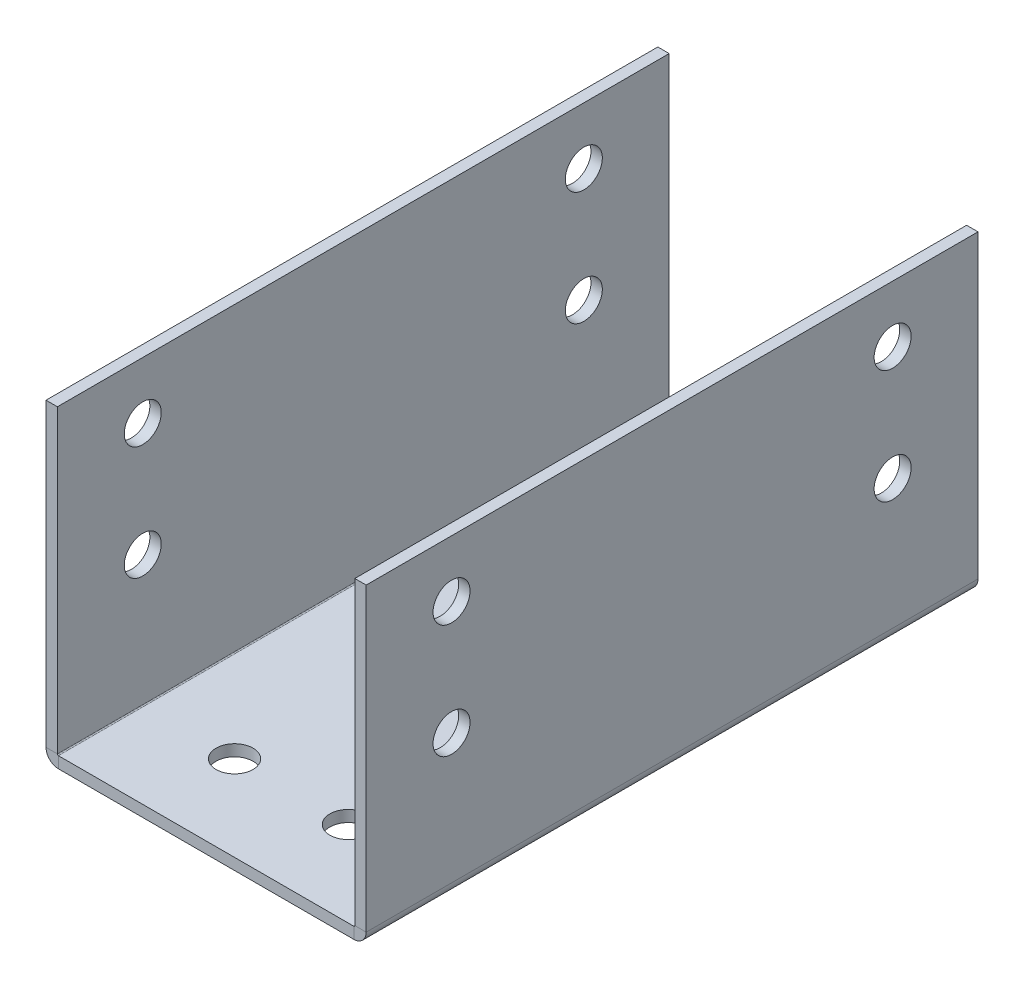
ISO-10303-21;
HEADER;
FILE_DESCRIPTION(('STEP AP214'),'2;1');
FILE_NAME('part.step','',(''),(''),'','','');
FILE_SCHEMA(('AUTOMOTIVE_DESIGN { 1 0 10303 214 1 1 1 1 }'));
ENDSEC;
DATA;
#1=APPLICATION_CONTEXT('core data for automotive mechanical design processes');
#2=APPLICATION_PROTOCOL_DEFINITION('international standard','automotive_design',2000,#1);
#3=PRODUCT_CONTEXT('',#1,'mechanical');
#4=PRODUCT('Part','Part','',(#3));
#5=PRODUCT_RELATED_PRODUCT_CATEGORY('part','',(#4));
#6=PRODUCT_DEFINITION_FORMATION('','',#4);
#7=PRODUCT_DEFINITION_CONTEXT('part definition',#1,'design');
#8=PRODUCT_DEFINITION('design','',#6,#7);
#9=PRODUCT_DEFINITION_SHAPE('','',#8);
#10=(LENGTH_UNIT() NAMED_UNIT(*) SI_UNIT(.MILLI.,.METRE.));
#11=(NAMED_UNIT(*) PLANE_ANGLE_UNIT() SI_UNIT($,.RADIAN.));
#12=(NAMED_UNIT(*) SI_UNIT($,.STERADIAN.) SOLID_ANGLE_UNIT());
#13=UNCERTAINTY_MEASURE_WITH_UNIT(LENGTH_MEASURE(1.E-05),#10,'distance_accuracy_value','');
#14=(GEOMETRIC_REPRESENTATION_CONTEXT(3) GLOBAL_UNCERTAINTY_ASSIGNED_CONTEXT((#13)) GLOBAL_UNIT_ASSIGNED_CONTEXT((#10,
#11,#12)) REPRESENTATION_CONTEXT('',''));
#15=CARTESIAN_POINT('',(0.,0.,0.));
#16=DIRECTION('',(0.,0.,1.));
#17=DIRECTION('',(1.,0.,0.));
#18=AXIS2_PLACEMENT_3D('',#15,#16,#17);
#19=CARTESIAN_POINT('',(0.,-8.,0.));
#20=DIRECTION('',(0.,0.,1.));
#21=DIRECTION('',(1.,0.,0.));
#22=AXIS2_PLACEMENT_3D('',#19,#20,#21);
#23=PLANE('',#22);
#24=DIRECTION('',(1.,0.,0.));
#25=VECTOR('',#24,1.);
#26=CARTESIAN_POINT('',(0.,-8.,0.));
#27=LINE('',#26,#25);
#28=CARTESIAN_POINT('',(-426.279883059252,-8.,0.));
#29=VERTEX_POINT('',#28);
#30=CARTESIAN_POINT('',(-218.720116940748,-8.00000000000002,-2.22044604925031E-13));
#31=VERTEX_POINT('',#30);
#32=EDGE_CURVE('E232',#29,#31,#27,.T.);
#33=ORIENTED_EDGE('',*,*,#32,.T.);
#34=DIRECTION('',(0.,1.,0.));
#35=VECTOR('',#34,1.);
#36=CARTESIAN_POINT('',(-218.720116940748,-8.,0.));
#37=LINE('',#36,#35);
#38=CARTESIAN_POINT('',(-218.720116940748,0.,0.));
#39=VERTEX_POINT('',#38);
#40=EDGE_CURVE('E12',#31,#39,#37,.T.);
#41=ORIENTED_EDGE('',*,*,#40,.T.);
#42=DIRECTION('',(1.,0.,0.));
#43=VECTOR('',#42,1.);
#44=CARTESIAN_POINT('',(0.,0.,0.));
#45=LINE('',#44,#43);
#46=CARTESIAN_POINT('',(-426.279883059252,0.,0.));
#47=VERTEX_POINT('',#46);
#48=EDGE_CURVE('E251',#47,#39,#45,.T.);
#49=ORIENTED_EDGE('',*,*,#48,.F.);
#50=DIRECTION('',(0.,1.,0.));
#51=VECTOR('',#50,1.);
#52=CARTESIAN_POINT('',(-426.279883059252,-8.,0.));
#53=LINE('',#52,#51);
#54=EDGE_CURVE('E231',#29,#47,#53,.T.);
#55=ORIENTED_EDGE('',*,*,#54,.F.);
#56=EDGE_LOOP('',(#33,#41,#49,#55));
#57=FACE_BOUND('',#56,.T.);
#58=ADVANCED_FACE('F47',(#57),#23,.T.);
#59=CARTESIAN_POINT('',(0.,-8.,-430.));
#60=DIRECTION('',(0.,0.,-1.));
#61=DIRECTION('',(-1.,0.,0.));
#62=AXIS2_PLACEMENT_3D('',#59,#60,#61);
#63=PLANE('',#62);
#64=DIRECTION('',(-1.,0.,0.));
#65=VECTOR('',#64,1.);
#66=CARTESIAN_POINT('',(0.,0.,-430.));
#67=LINE('',#66,#65);
#68=CARTESIAN_POINT('',(-218.720116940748,0.,-430.));
#69=VERTEX_POINT('',#68);
#70=CARTESIAN_POINT('',(-426.279883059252,0.,-430.));
#71=VERTEX_POINT('',#70);
#72=EDGE_CURVE('E71',#69,#71,#67,.T.);
#73=ORIENTED_EDGE('',*,*,#72,.F.);
#74=DIRECTION('',(0.,-1.,0.));
#75=VECTOR('',#74,1.);
#76=CARTESIAN_POINT('',(-218.720116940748,-8.,-430.));
#77=LINE('',#76,#75);
#78=CARTESIAN_POINT('',(-218.720116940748,-8.,-430.));
#79=VERTEX_POINT('',#78);
#80=EDGE_CURVE('E243',#69,#79,#77,.T.);
#81=ORIENTED_EDGE('',*,*,#80,.T.);
#82=DIRECTION('',(-1.,0.,0.));
#83=VECTOR('',#82,1.);
#84=CARTESIAN_POINT('',(0.,-8.,-430.));
#85=LINE('',#84,#83);
#86=CARTESIAN_POINT('',(-426.279883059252,-8.00000000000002,-430.));
#87=VERTEX_POINT('',#86);
#88=EDGE_CURVE('E249',#79,#87,#85,.T.);
#89=ORIENTED_EDGE('',*,*,#88,.T.);
#90=DIRECTION('',(0.,-1.,0.));
#91=VECTOR('',#90,1.);
#92=CARTESIAN_POINT('',(-426.279883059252,-8.,-430.));
#93=LINE('',#92,#91);
#94=EDGE_CURVE('E238',#71,#87,#93,.T.);
#95=ORIENTED_EDGE('',*,*,#94,.F.);
#96=EDGE_LOOP('',(#73,#81,#89,#95));
#97=FACE_BOUND('',#96,.T.);
#98=ADVANCED_FACE('F310',(#97),#63,.T.);
#99=CARTESIAN_POINT('',(0.,0.,0.));
#100=DIRECTION('',(0.,1.,0.));
#101=DIRECTION('',(0.,0.,1.));
#102=AXIS2_PLACEMENT_3D('',#99,#100,#101);
#103=PLANE('',#102);
#104=CARTESIAN_POINT('',(-282.499999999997,0.,-370.));
#105=DIRECTION('',(0.,1.,0.));
#106=DIRECTION('',(0.,0.,1.));
#107=AXIS2_PLACEMENT_3D('',#104,#105,#106);
#108=CIRCLE('',#107,13.);
#109=CARTESIAN_POINT('',(-282.499999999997,0.,-357.));
#110=VERTEX_POINT('',#109);
#111=EDGE_CURVE('E728',#110,#110,#108,.T.);
#112=ORIENTED_EDGE('',*,*,#111,.F.);
#113=EDGE_LOOP('',(#112));
#114=FACE_BOUND('',#113,.T.);
#115=CARTESIAN_POINT('',(-362.5,0.,-370.));
#116=DIRECTION('',(0.,1.,0.));
#117=DIRECTION('',(0.,0.,1.));
#118=AXIS2_PLACEMENT_3D('',#115,#116,#117);
#119=CIRCLE('',#118,13.0000000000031);
#120=CARTESIAN_POINT('',(-362.5,0.,-356.999999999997));
#121=VERTEX_POINT('',#120);
#122=EDGE_CURVE('E738',#121,#121,#119,.T.);
#123=ORIENTED_EDGE('',*,*,#122,.F.);
#124=EDGE_LOOP('',(#123));
#125=FACE_BOUND('',#124,.T.);
#126=CARTESIAN_POINT('',(-362.5,0.,-60.0000000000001));
#127=DIRECTION('',(0.,1.,0.));
#128=DIRECTION('',(0.,0.,1.));
#129=AXIS2_PLACEMENT_3D('',#126,#127,#128);
#130=CIRCLE('',#129,13.);
#131=CARTESIAN_POINT('',(-362.5,0.,-47.));
#132=VERTEX_POINT('',#131);
#133=EDGE_CURVE('E741',#132,#132,#130,.T.);
#134=ORIENTED_EDGE('',*,*,#133,.F.);
#135=EDGE_LOOP('',(#134));
#136=FACE_BOUND('',#135,.T.);
#137=CARTESIAN_POINT('',(-282.5,0.,-60.0000000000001));
#138=DIRECTION('',(0.,1.,0.));
#139=DIRECTION('',(0.,0.,1.));
#140=AXIS2_PLACEMENT_3D('',#137,#138,#139);
#141=CIRCLE('',#140,13.);
#142=CARTESIAN_POINT('',(-282.5,0.,-47.));
#143=VERTEX_POINT('',#142);
#144=EDGE_CURVE('E744',#143,#143,#141,.T.);
#145=ORIENTED_EDGE('',*,*,#144,.F.);
#146=EDGE_LOOP('',(#145));
#147=FACE_BOUND('',#146,.T.);
#148=ORIENTED_EDGE('',*,*,#48,.T.);
#149=DIRECTION('',(0.,0.,-1.));
#150=VECTOR('',#149,1.);
#151=CARTESIAN_POINT('',(-218.720116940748,0.,0.));
#152=LINE('',#151,#150);
#153=EDGE_CURVE('E55',#39,#69,#152,.T.);
#154=ORIENTED_EDGE('',*,*,#153,.T.);
#155=ORIENTED_EDGE('',*,*,#72,.T.);
#156=DIRECTION('',(0.,0.,-1.));
#157=VECTOR('',#156,1.);
#158=CARTESIAN_POINT('',(-426.279883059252,0.,0.));
#159=LINE('',#158,#157);
#160=EDGE_CURVE('E235',#47,#71,#159,.T.);
#161=ORIENTED_EDGE('',*,*,#160,.F.);
#162=EDGE_LOOP('',(#148,#154,#155,#161));
#163=FACE_BOUND('',#162,.T.);
#164=ADVANCED_FACE('F318',(#114,#125,#136,#147,#163),#103,.T.);
#165=CARTESIAN_POINT('',(0.,-8.,0.));
#166=DIRECTION('',(0.,1.,0.));
#167=DIRECTION('',(0.,0.,1.));
#168=AXIS2_PLACEMENT_3D('',#165,#166,#167);
#169=PLANE('',#168);
#170=CARTESIAN_POINT('',(-282.499999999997,-8.,-370.));
#171=DIRECTION('',(0.,-1.,0.));
#172=DIRECTION('',(0.,0.,-1.));
#173=AXIS2_PLACEMENT_3D('',#170,#171,#172);
#174=CIRCLE('',#173,13.);
#175=CARTESIAN_POINT('',(-282.499999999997,-8.,-383.));
#176=VERTEX_POINT('',#175);
#177=EDGE_CURVE('E751',#176,#176,#174,.T.);
#178=ORIENTED_EDGE('',*,*,#177,.F.);
#179=EDGE_LOOP('',(#178));
#180=FACE_BOUND('',#179,.T.);
#181=CARTESIAN_POINT('',(-362.5,-8.,-370.));
#182=DIRECTION('',(0.,-1.,0.));
#183=DIRECTION('',(0.,0.,-1.));
#184=AXIS2_PLACEMENT_3D('',#181,#182,#183);
#185=CIRCLE('',#184,13.0000000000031);
#186=CARTESIAN_POINT('',(-362.5,-8.,-383.000000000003));
#187=VERTEX_POINT('',#186);
#188=EDGE_CURVE('E754',#187,#187,#185,.T.);
#189=ORIENTED_EDGE('',*,*,#188,.F.);
#190=EDGE_LOOP('',(#189));
#191=FACE_BOUND('',#190,.T.);
#192=CARTESIAN_POINT('',(-362.5,-8.,-60.0000000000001));
#193=DIRECTION('',(0.,-1.,0.));
#194=DIRECTION('',(0.,0.,-1.));
#195=AXIS2_PLACEMENT_3D('',#192,#193,#194);
#196=CIRCLE('',#195,13.);
#197=CARTESIAN_POINT('',(-362.5,-8.,-73.0000000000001));
#198=VERTEX_POINT('',#197);
#199=EDGE_CURVE('E750',#198,#198,#196,.T.);
#200=ORIENTED_EDGE('',*,*,#199,.F.);
#201=EDGE_LOOP('',(#200));
#202=FACE_BOUND('',#201,.T.);
#203=CARTESIAN_POINT('',(-282.5,-8.,-60.0000000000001));
#204=DIRECTION('',(0.,-1.,0.));
#205=DIRECTION('',(0.,0.,-1.));
#206=AXIS2_PLACEMENT_3D('',#203,#204,#205);
#207=CIRCLE('',#206,13.);
#208=CARTESIAN_POINT('',(-282.5,-8.,-73.0000000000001));
#209=VERTEX_POINT('',#208);
#210=EDGE_CURVE('E747',#209,#209,#207,.T.);
#211=ORIENTED_EDGE('',*,*,#210,.F.);
#212=EDGE_LOOP('',(#211));
#213=FACE_BOUND('',#212,.T.);
#214=DIRECTION('',(0.,0.,-1.));
#215=VECTOR('',#214,1.);
#216=CARTESIAN_POINT('',(-218.720116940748,-8.,0.));
#217=LINE('',#216,#215);
#218=EDGE_CURVE('E241',#31,#79,#217,.T.);
#219=ORIENTED_EDGE('',*,*,#218,.F.);
#220=ORIENTED_EDGE('',*,*,#32,.F.);
#221=DIRECTION('',(0.,0.,-1.));
#222=VECTOR('',#221,1.);
#223=CARTESIAN_POINT('',(-426.279883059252,-8.,0.));
#224=LINE('',#223,#222);
#225=EDGE_CURVE('E229',#29,#87,#224,.T.);
#226=ORIENTED_EDGE('',*,*,#225,.T.);
#227=ORIENTED_EDGE('',*,*,#88,.F.);
#228=EDGE_LOOP('',(#219,#220,#226,#227));
#229=FACE_BOUND('',#228,.T.);
#230=ADVANCED_FACE('F297',(#180,#191,#202,#213,#229),#169,.F.);
#231=CARTESIAN_POINT('',(-426.279883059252,0.7366,1.11022302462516E-13));
#232=DIRECTION('',(0.,0.,1.));
#233=DIRECTION('',(1.,0.,0.));
#234=AXIS2_PLACEMENT_3D('',#231,#232,#233);
#235=PLANE('',#234);
#236=ORIENTED_EDGE('',*,*,#54,.T.);
#237=CARTESIAN_POINT('',(-426.279883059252,0.7366,1.66533453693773E-13));
#238=DIRECTION('',(0.,0.,-1.));
#239=DIRECTION('',(-1.,0.,0.));
#240=AXIS2_PLACEMENT_3D('',#237,#238,#239);
#241=CIRCLE('',#240,0.7366);
#242=CARTESIAN_POINT('',(-427.016483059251,0.736599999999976,0.));
#243=VERTEX_POINT('',#242);
#244=EDGE_CURVE('E190',#47,#243,#241,.T.);
#245=ORIENTED_EDGE('',*,*,#244,.T.);
#246=DIRECTION('',(1.,0.,0.));
#247=VECTOR('',#246,1.);
#248=CARTESIAN_POINT('',(-435.016483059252,0.736600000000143,0.));
#249=LINE('',#248,#247);
#250=CARTESIAN_POINT('',(-435.016483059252,0.736600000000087,0.));
#251=VERTEX_POINT('',#250);
#252=EDGE_CURVE('E205',#251,#243,#249,.T.);
#253=ORIENTED_EDGE('',*,*,#252,.F.);
#254=CARTESIAN_POINT('',(-426.279883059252,0.7366,1.11022302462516E-13));
#255=DIRECTION('',(0.,0.,-1.));
#256=DIRECTION('',(1.,0.,0.));
#257=AXIS2_PLACEMENT_3D('',#254,#255,#256);
#258=CIRCLE('',#257,8.73660000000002);
#259=EDGE_CURVE('E218',#29,#251,#258,.T.);
#260=ORIENTED_EDGE('',*,*,#259,.F.);
#261=EDGE_LOOP('',(#236,#245,#253,#260));
#262=FACE_BOUND('',#261,.T.);
#263=ADVANCED_FACE('F305',(#262),#235,.T.);
#264=CARTESIAN_POINT('',(-426.279883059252,0.7366,-430.));
#265=DIRECTION('',(0.,0.,-1.));
#266=DIRECTION('',(-1.,0.,0.));
#267=AXIS2_PLACEMENT_3D('',#264,#265,#266);
#268=PLANE('',#267);
#269=DIRECTION('',(-1.,0.,0.));
#270=VECTOR('',#269,1.);
#271=CARTESIAN_POINT('',(-435.016483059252,0.736600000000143,-430.));
#272=LINE('',#271,#270);
#273=CARTESIAN_POINT('',(-427.016483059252,0.736599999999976,-430.));
#274=VERTEX_POINT('',#273);
#275=CARTESIAN_POINT('',(-435.016483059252,0.736600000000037,-430.));
#276=VERTEX_POINT('',#275);
#277=EDGE_CURVE('E193',#274,#276,#272,.T.);
#278=ORIENTED_EDGE('',*,*,#277,.F.);
#279=CARTESIAN_POINT('',(-426.279883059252,0.7366,-429.999999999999));
#280=DIRECTION('',(0.,0.,-1.));
#281=DIRECTION('',(-1.,0.,0.));
#282=AXIS2_PLACEMENT_3D('',#279,#280,#281);
#283=CIRCLE('',#282,0.7366);
#284=EDGE_CURVE('E222',#274,#71,#283,.F.);
#285=ORIENTED_EDGE('',*,*,#284,.T.);
#286=ORIENTED_EDGE('',*,*,#94,.T.);
#287=CARTESIAN_POINT('',(-426.279883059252,0.7366,-430.));
#288=DIRECTION('',(0.,0.,1.));
#289=DIRECTION('',(-1.,0.,0.));
#290=AXIS2_PLACEMENT_3D('',#287,#288,#289);
#291=CIRCLE('',#290,8.73660000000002);
#292=EDGE_CURVE('E221',#276,#87,#291,.T.);
#293=ORIENTED_EDGE('',*,*,#292,.F.);
#294=EDGE_LOOP('',(#278,#285,#286,#293));
#295=FACE_BOUND('',#294,.T.);
#296=ADVANCED_FACE('F313',(#295),#268,.T.);
#297=CARTESIAN_POINT('',(-426.279883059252,0.7366,215.138764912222));
#298=DIRECTION('',(0.,0.,-1.));
#299=DIRECTION('',(-1.,0.,0.));
#300=AXIS2_PLACEMENT_3D('',#297,#298,#299);
#301=CYLINDRICAL_SURFACE('',#300,8.7366);
#302=ORIENTED_EDGE('',*,*,#292,.T.);
#303=ORIENTED_EDGE('',*,*,#225,.F.);
#304=ORIENTED_EDGE('',*,*,#259,.T.);
#305=DIRECTION('',(0.,0.,-1.));
#306=VECTOR('',#305,1.);
#307=CARTESIAN_POINT('',(-435.016483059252,0.736600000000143,0.));
#308=LINE('',#307,#306);
#309=EDGE_CURVE('E183',#251,#276,#308,.T.);
#310=ORIENTED_EDGE('',*,*,#309,.T.);
#311=EDGE_LOOP('',(#302,#303,#304,#310));
#312=FACE_BOUND('',#311,.T.);
#313=ADVANCED_FACE('F307',(#312),#301,.T.);
#314=CARTESIAN_POINT('',(-426.279883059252,0.7366,215.138764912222));
#315=DIRECTION('',(0.,0.,-1.));
#316=DIRECTION('',(-1.,0.,0.));
#317=AXIS2_PLACEMENT_3D('',#314,#315,#316);
#318=CYLINDRICAL_SURFACE('',#317,0.7366);
#319=ORIENTED_EDGE('',*,*,#284,.F.);
#320=DIRECTION('',(0.,0.,-1.));
#321=VECTOR('',#320,1.);
#322=CARTESIAN_POINT('',(-427.016483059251,0.736600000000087,0.));
#323=LINE('',#322,#321);
#324=EDGE_CURVE('E200',#243,#274,#323,.T.);
#325=ORIENTED_EDGE('',*,*,#324,.F.);
#326=ORIENTED_EDGE('',*,*,#244,.F.);
#327=ORIENTED_EDGE('',*,*,#160,.T.);
#328=EDGE_LOOP('',(#319,#325,#326,#327));
#329=FACE_BOUND('',#328,.T.);
#330=ADVANCED_FACE('F317',(#329),#318,.F.);
#331=CARTESIAN_POINT('',(-435.016483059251,212.016483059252,0.));
#332=DIRECTION('',(0.,1.,0.));
#333=DIRECTION('',(0.,0.,1.));
#334=AXIS2_PLACEMENT_3D('',#331,#332,#333);
#335=PLANE('',#334);
#336=DIRECTION('',(0.,0.,1.));
#337=VECTOR('',#336,1.);
#338=CARTESIAN_POINT('',(-427.016483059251,212.016483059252,0.));
#339=LINE('',#338,#337);
#340=CARTESIAN_POINT('',(-427.016483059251,212.016483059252,-430.));
#341=VERTEX_POINT('',#340);
#342=CARTESIAN_POINT('',(-427.016483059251,212.016483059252,0.));
#343=VERTEX_POINT('',#342);
#344=EDGE_CURVE('E195',#341,#343,#339,.T.);
#345=ORIENTED_EDGE('',*,*,#344,.F.);
#346=DIRECTION('',(1.,0.,0.));
#347=VECTOR('',#346,1.);
#348=CARTESIAN_POINT('',(-435.016483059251,212.016483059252,-430.));
#349=LINE('',#348,#347);
#350=CARTESIAN_POINT('',(-435.016483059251,212.016483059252,-430.));
#351=VERTEX_POINT('',#350);
#352=EDGE_CURVE('E187',#351,#341,#349,.T.);
#353=ORIENTED_EDGE('',*,*,#352,.F.);
#354=DIRECTION('',(0.,0.,1.));
#355=VECTOR('',#354,1.);
#356=CARTESIAN_POINT('',(-435.016483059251,212.016483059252,0.));
#357=LINE('',#356,#355);
#358=CARTESIAN_POINT('',(-435.016483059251,212.016483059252,0.));
#359=VERTEX_POINT('',#358);
#360=EDGE_CURVE('E213',#351,#359,#357,.T.);
#361=ORIENTED_EDGE('',*,*,#360,.T.);
#362=DIRECTION('',(1.,0.,0.));
#363=VECTOR('',#362,1.);
#364=CARTESIAN_POINT('',(-435.016483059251,212.016483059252,0.));
#365=LINE('',#364,#363);
#366=EDGE_CURVE('E211',#359,#343,#365,.T.);
#367=ORIENTED_EDGE('',*,*,#366,.T.);
#368=EDGE_LOOP('',(#345,#353,#361,#367));
#369=FACE_BOUND('',#368,.T.);
#370=ADVANCED_FACE('F356',(#369),#335,.T.);
#371=CARTESIAN_POINT('',(-435.016483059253,-432.983516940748,0.));
#372=DIRECTION('',(1.,0.,0.));
#373=DIRECTION('',(0.,0.,1.));
#374=AXIS2_PLACEMENT_3D('',#371,#372,#373);
#375=PLANE('',#374);
#376=CARTESIAN_POINT('',(-435.016483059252,92.0164830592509,-60.));
#377=DIRECTION('',(1.,0.,0.));
#378=DIRECTION('',(0.,1.,0.));
#379=AXIS2_PLACEMENT_3D('',#376,#377,#378);
#380=CIRCLE('',#379,13.0000000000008);
#381=CARTESIAN_POINT('',(-435.016483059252,105.016483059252,-60.));
#382=VERTEX_POINT('',#381);
#383=EDGE_CURVE('E725',#382,#382,#380,.T.);
#384=ORIENTED_EDGE('',*,*,#383,.T.);
#385=EDGE_LOOP('',(#384));
#386=FACE_BOUND('',#385,.T.);
#387=CARTESIAN_POINT('',(-435.016483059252,92.0164830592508,-370.000000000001));
#388=DIRECTION('',(1.,0.,0.));
#389=DIRECTION('',(0.,1.,0.));
#390=AXIS2_PLACEMENT_3D('',#387,#388,#389);
#391=CIRCLE('',#390,13.);
#392=CARTESIAN_POINT('',(-435.016483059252,105.016483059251,-370.000000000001));
#393=VERTEX_POINT('',#392);
#394=EDGE_CURVE('E730',#393,#393,#391,.T.);
#395=ORIENTED_EDGE('',*,*,#394,.T.);
#396=EDGE_LOOP('',(#395));
#397=FACE_BOUND('',#396,.T.);
#398=CARTESIAN_POINT('',(-435.016483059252,172.016483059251,-370.));
#399=DIRECTION('',(1.,0.,0.));
#400=DIRECTION('',(0.,1.,0.));
#401=AXIS2_PLACEMENT_3D('',#398,#399,#400);
#402=CIRCLE('',#401,13.);
#403=CARTESIAN_POINT('',(-435.016483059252,185.016483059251,-370.));
#404=VERTEX_POINT('',#403);
#405=EDGE_CURVE('E722',#404,#404,#402,.T.);
#406=ORIENTED_EDGE('',*,*,#405,.T.);
#407=EDGE_LOOP('',(#406));
#408=FACE_BOUND('',#407,.T.);
#409=CARTESIAN_POINT('',(-435.016483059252,172.016483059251,-60.));
#410=DIRECTION('',(1.,0.,0.));
#411=DIRECTION('',(0.,1.,0.));
#412=AXIS2_PLACEMENT_3D('',#409,#410,#411);
#413=CIRCLE('',#412,13.);
#414=CARTESIAN_POINT('',(-435.016483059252,185.016483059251,-60.));
#415=VERTEX_POINT('',#414);
#416=EDGE_CURVE('E260',#415,#415,#413,.T.);
#417=ORIENTED_EDGE('',*,*,#416,.T.);
#418=EDGE_LOOP('',(#417));
#419=FACE_BOUND('',#418,.T.);
#420=ORIENTED_EDGE('',*,*,#309,.F.);
#421=DIRECTION('',(0.,-1.,0.));
#422=VECTOR('',#421,1.);
#423=CARTESIAN_POINT('',(-435.016483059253,-432.983516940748,0.));
#424=LINE('',#423,#422);
#425=EDGE_CURVE('E208',#359,#251,#424,.T.);
#426=ORIENTED_EDGE('',*,*,#425,.F.);
#427=ORIENTED_EDGE('',*,*,#360,.F.);
#428=DIRECTION('',(0.,1.,0.));
#429=VECTOR('',#428,1.);
#430=CARTESIAN_POINT('',(-435.016483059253,-432.983516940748,-430.));
#431=LINE('',#430,#429);
#432=EDGE_CURVE('E191',#276,#351,#431,.T.);
#433=ORIENTED_EDGE('',*,*,#432,.F.);
#434=EDGE_LOOP('',(#420,#426,#427,#433));
#435=FACE_BOUND('',#434,.T.);
#436=ADVANCED_FACE('F365',(#386,#397,#408,#419,#435),#375,.F.);
#437=CARTESIAN_POINT('',(-435.016483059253,-432.983516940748,0.));
#438=DIRECTION('',(0.,0.,1.));
#439=DIRECTION('',(0.,-1.,0.));
#440=AXIS2_PLACEMENT_3D('',#437,#438,#439);
#441=PLANE('',#440);
#442=ORIENTED_EDGE('',*,*,#425,.T.);
#443=ORIENTED_EDGE('',*,*,#252,.T.);
#444=DIRECTION('',(0.,-1.,0.));
#445=VECTOR('',#444,1.);
#446=CARTESIAN_POINT('',(-427.016483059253,-432.983516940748,0.));
#447=LINE('',#446,#445);
#448=EDGE_CURVE('E203',#343,#243,#447,.T.);
#449=ORIENTED_EDGE('',*,*,#448,.F.);
#450=ORIENTED_EDGE('',*,*,#366,.F.);
#451=EDGE_LOOP('',(#442,#443,#449,#450));
#452=FACE_BOUND('',#451,.T.);
#453=ADVANCED_FACE('F361',(#452),#441,.T.);
#454=CARTESIAN_POINT('',(-427.016483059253,-432.983516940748,0.));
#455=DIRECTION('',(1.,0.,0.));
#456=DIRECTION('',(0.,0.,1.));
#457=AXIS2_PLACEMENT_3D('',#454,#455,#456);
#458=PLANE('',#457);
#459=CARTESIAN_POINT('',(-427.016483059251,92.0164830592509,-60.));
#460=DIRECTION('',(1.,0.,0.));
#461=DIRECTION('',(0.,1.,0.));
#462=AXIS2_PLACEMENT_3D('',#459,#460,#461);
#463=CIRCLE('',#462,13.0000000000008);
#464=CARTESIAN_POINT('',(-427.016483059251,105.016483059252,-60.));
#465=VERTEX_POINT('',#464);
#466=EDGE_CURVE('E175',#465,#465,#463,.T.);
#467=ORIENTED_EDGE('',*,*,#466,.F.);
#468=EDGE_LOOP('',(#467));
#469=FACE_BOUND('',#468,.T.);
#470=CARTESIAN_POINT('',(-427.016483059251,92.0164830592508,-370.000000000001));
#471=DIRECTION('',(1.,0.,0.));
#472=DIRECTION('',(0.,1.,0.));
#473=AXIS2_PLACEMENT_3D('',#470,#471,#472);
#474=CIRCLE('',#473,13.);
#475=CARTESIAN_POINT('',(-427.016483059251,105.016483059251,-370.000000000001));
#476=VERTEX_POINT('',#475);
#477=EDGE_CURVE('E266',#476,#476,#474,.T.);
#478=ORIENTED_EDGE('',*,*,#477,.F.);
#479=EDGE_LOOP('',(#478));
#480=FACE_BOUND('',#479,.T.);
#481=CARTESIAN_POINT('',(-427.016483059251,172.016483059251,-370.));
#482=DIRECTION('',(1.,0.,0.));
#483=DIRECTION('',(0.,1.,0.));
#484=AXIS2_PLACEMENT_3D('',#481,#482,#483);
#485=CIRCLE('',#484,13.);
#486=CARTESIAN_POINT('',(-427.016483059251,185.016483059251,-370.));
#487=VERTEX_POINT('',#486);
#488=EDGE_CURVE('E263',#487,#487,#485,.T.);
#489=ORIENTED_EDGE('',*,*,#488,.F.);
#490=EDGE_LOOP('',(#489));
#491=FACE_BOUND('',#490,.T.);
#492=CARTESIAN_POINT('',(-427.016483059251,172.016483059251,-60.));
#493=DIRECTION('',(1.,0.,0.));
#494=DIRECTION('',(0.,1.,0.));
#495=AXIS2_PLACEMENT_3D('',#492,#493,#494);
#496=CIRCLE('',#495,13.);
#497=CARTESIAN_POINT('',(-427.016483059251,185.016483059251,-60.));
#498=VERTEX_POINT('',#497);
#499=EDGE_CURVE('E259',#498,#498,#496,.T.);
#500=ORIENTED_EDGE('',*,*,#499,.F.);
#501=EDGE_LOOP('',(#500));
#502=FACE_BOUND('',#501,.T.);
#503=ORIENTED_EDGE('',*,*,#448,.T.);
#504=ORIENTED_EDGE('',*,*,#324,.T.);
#505=DIRECTION('',(0.,1.,0.));
#506=VECTOR('',#505,1.);
#507=CARTESIAN_POINT('',(-427.016483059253,-432.983516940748,-430.));
#508=LINE('',#507,#506);
#509=EDGE_CURVE('E198',#274,#341,#508,.T.);
#510=ORIENTED_EDGE('',*,*,#509,.T.);
#511=ORIENTED_EDGE('',*,*,#344,.T.);
#512=EDGE_LOOP('',(#503,#504,#510,#511));
#513=FACE_BOUND('',#512,.T.);
#514=ADVANCED_FACE('F333',(#469,#480,#491,#502,#513),#458,.T.);
#515=CARTESIAN_POINT('',(-435.016483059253,-432.983516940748,-430.));
#516=DIRECTION('',(0.,0.,-1.));
#517=DIRECTION('',(0.,1.,0.));
#518=AXIS2_PLACEMENT_3D('',#515,#516,#517);
#519=PLANE('',#518);
#520=ORIENTED_EDGE('',*,*,#509,.F.);
#521=ORIENTED_EDGE('',*,*,#277,.T.);
#522=ORIENTED_EDGE('',*,*,#432,.T.);
#523=ORIENTED_EDGE('',*,*,#352,.T.);
#524=EDGE_LOOP('',(#520,#521,#522,#523));
#525=FACE_BOUND('',#524,.T.);
#526=ADVANCED_FACE('F326',(#525),#519,.T.);
#527=CARTESIAN_POINT('',(-218.720116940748,0.7366,-2.22044604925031E-13));
#528=DIRECTION('',(0.,0.,1.));
#529=DIRECTION('',(1.,0.,0.));
#530=AXIS2_PLACEMENT_3D('',#527,#528,#529);
#531=PLANE('',#530);
#532=DIRECTION('',(-1.,0.,0.));
#533=VECTOR('',#532,1.);
#534=CARTESIAN_POINT('',(-209.983516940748,0.736599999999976,0.));
#535=LINE('',#534,#533);
#536=CARTESIAN_POINT('',(-209.983516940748,0.736600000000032,0.));
#537=VERTEX_POINT('',#536);
#538=CARTESIAN_POINT('',(-217.983516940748,0.736600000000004,0.));
#539=VERTEX_POINT('',#538);
#540=EDGE_CURVE('E145',#537,#539,#535,.T.);
#541=ORIENTED_EDGE('',*,*,#540,.T.);
#542=CARTESIAN_POINT('',(-218.720116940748,0.7366,-4.44089209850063E-13));
#543=DIRECTION('',(0.,0.,1.));
#544=DIRECTION('',(1.,0.,0.));
#545=AXIS2_PLACEMENT_3D('',#542,#543,#544);
#546=CIRCLE('',#545,0.7366);
#547=EDGE_CURVE('E63',#539,#39,#546,.F.);
#548=ORIENTED_EDGE('',*,*,#547,.T.);
#549=ORIENTED_EDGE('',*,*,#40,.F.);
#550=CARTESIAN_POINT('',(-218.720116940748,0.7366,-2.22044604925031E-13));
#551=DIRECTION('',(0.,0.,-1.));
#552=DIRECTION('',(1.,0.,0.));
#553=AXIS2_PLACEMENT_3D('',#550,#551,#552);
#554=CIRCLE('',#553,8.73660000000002);
#555=EDGE_CURVE('E176',#537,#31,#554,.T.);
#556=ORIENTED_EDGE('',*,*,#555,.F.);
#557=EDGE_LOOP('',(#541,#548,#549,#556));
#558=FACE_BOUND('',#557,.T.);
#559=ADVANCED_FACE('F324',(#558),#531,.T.);
#560=CARTESIAN_POINT('',(-218.720116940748,0.7366,-430.));
#561=DIRECTION('',(0.,0.,-1.));
#562=DIRECTION('',(-1.,0.,0.));
#563=AXIS2_PLACEMENT_3D('',#560,#561,#562);
#564=PLANE('',#563);
#565=ORIENTED_EDGE('',*,*,#80,.F.);
#566=CARTESIAN_POINT('',(-218.720116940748,0.7366,-430.));
#567=DIRECTION('',(0.,0.,1.));
#568=DIRECTION('',(1.,0.,0.));
#569=AXIS2_PLACEMENT_3D('',#566,#567,#568);
#570=CIRCLE('',#569,0.7366);
#571=CARTESIAN_POINT('',(-217.983516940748,0.736600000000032,-430.));
#572=VERTEX_POINT('',#571);
#573=EDGE_CURVE('E180',#69,#572,#570,.T.);
#574=ORIENTED_EDGE('',*,*,#573,.T.);
#575=DIRECTION('',(1.,0.,0.));
#576=VECTOR('',#575,1.);
#577=CARTESIAN_POINT('',(-209.983516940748,0.736599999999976,-430.));
#578=LINE('',#577,#576);
#579=CARTESIAN_POINT('',(-209.983516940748,0.736600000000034,-430.));
#580=VERTEX_POINT('',#579);
#581=EDGE_CURVE('E163',#572,#580,#578,.T.);
#582=ORIENTED_EDGE('',*,*,#581,.T.);
#583=CARTESIAN_POINT('',(-218.720116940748,0.7366,-430.));
#584=DIRECTION('',(0.,0.,1.));
#585=DIRECTION('',(-1.,0.,0.));
#586=AXIS2_PLACEMENT_3D('',#583,#584,#585);
#587=CIRCLE('',#586,8.73660000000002);
#588=EDGE_CURVE('E179',#79,#580,#587,.T.);
#589=ORIENTED_EDGE('',*,*,#588,.F.);
#590=EDGE_LOOP('',(#565,#574,#582,#589));
#591=FACE_BOUND('',#590,.T.);
#592=ADVANCED_FACE('F289',(#591),#564,.T.);
#593=CARTESIAN_POINT('',(-218.720116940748,0.7366,-645.138764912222));
#594=DIRECTION('',(0.,0.,1.));
#595=DIRECTION('',(1.,0.,0.));
#596=AXIS2_PLACEMENT_3D('',#593,#594,#595);
#597=CYLINDRICAL_SURFACE('',#596,8.7366);
#598=ORIENTED_EDGE('',*,*,#588,.T.);
#599=DIRECTION('',(0.,0.,-1.));
#600=VECTOR('',#599,1.);
#601=CARTESIAN_POINT('',(-209.983516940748,0.736599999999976,0.));
#602=LINE('',#601,#600);
#603=EDGE_CURVE('E165',#537,#580,#602,.T.);
#604=ORIENTED_EDGE('',*,*,#603,.F.);
#605=ORIENTED_EDGE('',*,*,#555,.T.);
#606=ORIENTED_EDGE('',*,*,#218,.T.);
#607=EDGE_LOOP('',(#598,#604,#605,#606));
#608=FACE_BOUND('',#607,.T.);
#609=ADVANCED_FACE('F294',(#608),#597,.T.);
#610=CARTESIAN_POINT('',(-218.720116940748,0.7366,-645.138764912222));
#611=DIRECTION('',(0.,0.,1.));
#612=DIRECTION('',(1.,0.,0.));
#613=AXIS2_PLACEMENT_3D('',#610,#611,#612);
#614=CYLINDRICAL_SURFACE('',#613,0.7366);
#615=ORIENTED_EDGE('',*,*,#573,.F.);
#616=ORIENTED_EDGE('',*,*,#153,.F.);
#617=ORIENTED_EDGE('',*,*,#547,.F.);
#618=DIRECTION('',(0.,0.,-1.));
#619=VECTOR('',#618,1.);
#620=CARTESIAN_POINT('',(-217.983516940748,0.736599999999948,0.));
#621=LINE('',#620,#619);
#622=EDGE_CURVE('E168',#539,#572,#621,.T.);
#623=ORIENTED_EDGE('',*,*,#622,.T.);
#624=EDGE_LOOP('',(#615,#616,#617,#623));
#625=FACE_BOUND('',#624,.T.);
#626=ADVANCED_FACE('F320',(#625),#614,.F.);
#627=CARTESIAN_POINT('',(-209.983516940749,212.016483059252,0.));
#628=DIRECTION('',(0.,1.,0.));
#629=DIRECTION('',(0.,0.,-1.));
#630=AXIS2_PLACEMENT_3D('',#627,#628,#629);
#631=PLANE('',#630);
#632=DIRECTION('',(0.,0.,-1.));
#633=VECTOR('',#632,1.);
#634=CARTESIAN_POINT('',(-217.983516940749,212.016483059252,0.));
#635=LINE('',#634,#633);
#636=CARTESIAN_POINT('',(-217.983516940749,212.016483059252,0.));
#637=VERTEX_POINT('',#636);
#638=CARTESIAN_POINT('',(-217.983516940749,212.016483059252,-430.));
#639=VERTEX_POINT('',#638);
#640=EDGE_CURVE('E157',#637,#639,#635,.T.);
#641=ORIENTED_EDGE('',*,*,#640,.F.);
#642=DIRECTION('',(-1.,0.,0.));
#643=VECTOR('',#642,1.);
#644=CARTESIAN_POINT('',(-209.983516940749,212.016483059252,0.));
#645=LINE('',#644,#643);
#646=CARTESIAN_POINT('',(-209.983516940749,212.016483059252,0.));
#647=VERTEX_POINT('',#646);
#648=EDGE_CURVE('E143',#647,#637,#645,.T.);
#649=ORIENTED_EDGE('',*,*,#648,.F.);
#650=DIRECTION('',(0.,0.,-1.));
#651=VECTOR('',#650,1.);
#652=CARTESIAN_POINT('',(-209.983516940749,212.016483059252,0.));
#653=LINE('',#652,#651);
#654=CARTESIAN_POINT('',(-209.983516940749,212.016483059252,-430.));
#655=VERTEX_POINT('',#654);
#656=EDGE_CURVE('E155',#647,#655,#653,.T.);
#657=ORIENTED_EDGE('',*,*,#656,.T.);
#658=DIRECTION('',(-1.,0.,0.));
#659=VECTOR('',#658,1.);
#660=CARTESIAN_POINT('',(-209.983516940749,212.016483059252,-430.));
#661=LINE('',#660,#659);
#662=EDGE_CURVE('E162',#655,#639,#661,.T.);
#663=ORIENTED_EDGE('',*,*,#662,.T.);
#664=EDGE_LOOP('',(#641,#649,#657,#663));
#665=FACE_BOUND('',#664,.T.);
#666=ADVANCED_FACE('F154',(#665),#631,.T.);
#667=CARTESIAN_POINT('',(-209.983516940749,212.016483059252,0.));
#668=DIRECTION('',(-1.,0.,0.));
#669=DIRECTION('',(0.,0.,1.));
#670=AXIS2_PLACEMENT_3D('',#667,#668,#669);
#671=PLANE('',#670);
#672=CARTESIAN_POINT('',(-209.983516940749,92.0164830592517,-60.));
#673=DIRECTION('',(1.,0.,0.));
#674=DIRECTION('',(0.,1.,0.));
#675=AXIS2_PLACEMENT_3D('',#672,#673,#674);
#676=CIRCLE('',#675,13.0000000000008);
#677=CARTESIAN_POINT('',(-209.983516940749,105.016483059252,-60.));
#678=VERTEX_POINT('',#677);
#679=EDGE_CURVE('E707',#678,#678,#676,.T.);
#680=ORIENTED_EDGE('',*,*,#679,.F.);
#681=EDGE_LOOP('',(#680));
#682=FACE_BOUND('',#681,.T.);
#683=CARTESIAN_POINT('',(-209.983516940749,92.0164830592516,-370.000000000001));
#684=DIRECTION('',(1.,0.,0.));
#685=DIRECTION('',(0.,1.,0.));
#686=AXIS2_PLACEMENT_3D('',#683,#684,#685);
#687=CIRCLE('',#686,13.);
#688=CARTESIAN_POINT('',(-209.983516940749,105.016483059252,-370.000000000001));
#689=VERTEX_POINT('',#688);
#690=EDGE_CURVE('E711',#689,#689,#687,.T.);
#691=ORIENTED_EDGE('',*,*,#690,.F.);
#692=EDGE_LOOP('',(#691));
#693=FACE_BOUND('',#692,.T.);
#694=CARTESIAN_POINT('',(-209.983516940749,172.016483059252,-370.));
#695=DIRECTION('',(1.,0.,0.));
#696=DIRECTION('',(0.,1.,0.));
#697=AXIS2_PLACEMENT_3D('',#694,#695,#696);
#698=CIRCLE('',#697,13.);
#699=CARTESIAN_POINT('',(-209.983516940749,185.016483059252,-370.));
#700=VERTEX_POINT('',#699);
#701=EDGE_CURVE('E715',#700,#700,#698,.T.);
#702=ORIENTED_EDGE('',*,*,#701,.F.);
#703=EDGE_LOOP('',(#702));
#704=FACE_BOUND('',#703,.T.);
#705=CARTESIAN_POINT('',(-209.983516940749,172.016483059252,-60.));
#706=DIRECTION('',(1.,0.,0.));
#707=DIRECTION('',(0.,1.,0.));
#708=AXIS2_PLACEMENT_3D('',#705,#706,#707);
#709=CIRCLE('',#708,13.);
#710=CARTESIAN_POINT('',(-209.983516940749,185.016483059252,-60.));
#711=VERTEX_POINT('',#710);
#712=EDGE_CURVE('E718',#711,#711,#709,.T.);
#713=ORIENTED_EDGE('',*,*,#712,.F.);
#714=EDGE_LOOP('',(#713));
#715=FACE_BOUND('',#714,.T.);
#716=DIRECTION('',(0.,1.,0.));
#717=VECTOR('',#716,1.);
#718=CARTESIAN_POINT('',(-209.983516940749,212.016483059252,0.));
#719=LINE('',#718,#717);
#720=EDGE_CURVE('E140',#537,#647,#719,.T.);
#721=ORIENTED_EDGE('',*,*,#720,.F.);
#722=ORIENTED_EDGE('',*,*,#603,.T.);
#723=DIRECTION('',(0.,-1.,0.));
#724=VECTOR('',#723,1.);
#725=CARTESIAN_POINT('',(-209.983516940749,212.016483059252,-430.));
#726=LINE('',#725,#724);
#727=EDGE_CURVE('E161',#655,#580,#726,.T.);
#728=ORIENTED_EDGE('',*,*,#727,.F.);
#729=ORIENTED_EDGE('',*,*,#656,.F.);
#730=EDGE_LOOP('',(#721,#722,#728,#729));
#731=FACE_BOUND('',#730,.T.);
#732=ADVANCED_FACE('F160',(#682,#693,#704,#715,#731),#671,.F.);
#733=CARTESIAN_POINT('',(-209.983516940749,212.016483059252,-430.));
#734=DIRECTION('',(0.,0.,-1.));
#735=DIRECTION('',(0.,-1.,0.));
#736=AXIS2_PLACEMENT_3D('',#733,#734,#735);
#737=PLANE('',#736);
#738=ORIENTED_EDGE('',*,*,#581,.F.);
#739=DIRECTION('',(0.,-1.,0.));
#740=VECTOR('',#739,1.);
#741=CARTESIAN_POINT('',(-217.983516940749,212.016483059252,-430.));
#742=LINE('',#741,#740);
#743=EDGE_CURVE('E150',#639,#572,#742,.T.);
#744=ORIENTED_EDGE('',*,*,#743,.F.);
#745=ORIENTED_EDGE('',*,*,#662,.F.);
#746=ORIENTED_EDGE('',*,*,#727,.T.);
#747=EDGE_LOOP('',(#738,#744,#745,#746));
#748=FACE_BOUND('',#747,.T.);
#749=ADVANCED_FACE('F450',(#748),#737,.T.);
#750=CARTESIAN_POINT('',(-217.983516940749,212.016483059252,0.));
#751=DIRECTION('',(-1.,0.,0.));
#752=DIRECTION('',(0.,0.,1.));
#753=AXIS2_PLACEMENT_3D('',#750,#751,#752);
#754=PLANE('',#753);
#755=CARTESIAN_POINT('',(-217.983516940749,92.0164830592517,-60.));
#756=DIRECTION('',(-1.,0.,0.));
#757=DIRECTION('',(0.,-1.,0.));
#758=AXIS2_PLACEMENT_3D('',#755,#756,#757);
#759=CIRCLE('',#758,13.0000000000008);
#760=CARTESIAN_POINT('',(-217.983516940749,79.0164830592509,-60.));
#761=VERTEX_POINT('',#760);
#762=EDGE_CURVE('E50',#761,#761,#759,.T.);
#763=ORIENTED_EDGE('',*,*,#762,.F.);
#764=EDGE_LOOP('',(#763));
#765=FACE_BOUND('',#764,.T.);
#766=CARTESIAN_POINT('',(-217.983516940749,92.0164830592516,-370.000000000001));
#767=DIRECTION('',(-1.,0.,0.));
#768=DIRECTION('',(0.,-1.,0.));
#769=AXIS2_PLACEMENT_3D('',#766,#767,#768);
#770=CIRCLE('',#769,13.);
#771=CARTESIAN_POINT('',(-217.983516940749,79.0164830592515,-370.000000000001));
#772=VERTEX_POINT('',#771);
#773=EDGE_CURVE('E264',#772,#772,#770,.T.);
#774=ORIENTED_EDGE('',*,*,#773,.F.);
#775=EDGE_LOOP('',(#774));
#776=FACE_BOUND('',#775,.T.);
#777=CARTESIAN_POINT('',(-217.983516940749,172.016483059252,-370.));
#778=DIRECTION('',(-1.,0.,0.));
#779=DIRECTION('',(0.,-1.,0.));
#780=AXIS2_PLACEMENT_3D('',#777,#778,#779);
#781=CIRCLE('',#780,13.);
#782=CARTESIAN_POINT('',(-217.983516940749,159.016483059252,-370.));
#783=VERTEX_POINT('',#782);
#784=EDGE_CURVE('E261',#783,#783,#781,.T.);
#785=ORIENTED_EDGE('',*,*,#784,.F.);
#786=EDGE_LOOP('',(#785));
#787=FACE_BOUND('',#786,.T.);
#788=CARTESIAN_POINT('',(-217.983516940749,172.016483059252,-60.));
#789=DIRECTION('',(-1.,0.,0.));
#790=DIRECTION('',(0.,-1.,0.));
#791=AXIS2_PLACEMENT_3D('',#788,#789,#790);
#792=CIRCLE('',#791,13.);
#793=CARTESIAN_POINT('',(-217.983516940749,159.016483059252,-60.));
#794=VERTEX_POINT('',#793);
#795=EDGE_CURVE('E256',#794,#794,#792,.T.);
#796=ORIENTED_EDGE('',*,*,#795,.F.);
#797=EDGE_LOOP('',(#796));
#798=FACE_BOUND('',#797,.T.);
#799=ORIENTED_EDGE('',*,*,#622,.F.);
#800=DIRECTION('',(0.,1.,0.));
#801=VECTOR('',#800,1.);
#802=CARTESIAN_POINT('',(-217.983516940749,212.016483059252,0.));
#803=LINE('',#802,#801);
#804=EDGE_CURVE('E282',#539,#637,#803,.T.);
#805=ORIENTED_EDGE('',*,*,#804,.T.);
#806=ORIENTED_EDGE('',*,*,#640,.T.);
#807=ORIENTED_EDGE('',*,*,#743,.T.);
#808=EDGE_LOOP('',(#799,#805,#806,#807));
#809=FACE_BOUND('',#808,.T.);
#810=ADVANCED_FACE('F323',(#765,#776,#787,#798,#809),#754,.T.);
#811=CARTESIAN_POINT('',(-209.983516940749,212.016483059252,0.));
#812=DIRECTION('',(0.,0.,1.));
#813=DIRECTION('',(0.,1.,0.));
#814=AXIS2_PLACEMENT_3D('',#811,#812,#813);
#815=PLANE('',#814);
#816=ORIENTED_EDGE('',*,*,#540,.F.);
#817=ORIENTED_EDGE('',*,*,#720,.T.);
#818=ORIENTED_EDGE('',*,*,#648,.T.);
#819=ORIENTED_EDGE('',*,*,#804,.F.);
#820=EDGE_LOOP('',(#816,#817,#818,#819));
#821=FACE_BOUND('',#820,.T.);
#822=ADVANCED_FACE('F142',(#821),#815,.T.);
#823=CARTESIAN_POINT('',(-435.016483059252,172.016483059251,-60.));
#824=DIRECTION('',(1.,0.,0.));
#825=DIRECTION('',(0.,1.,0.));
#826=AXIS2_PLACEMENT_3D('',#823,#824,#825);
#827=CYLINDRICAL_SURFACE('',#826,13.);
#828=ORIENTED_EDGE('',*,*,#795,.T.);
#829=EDGE_LOOP('',(#828));
#830=FACE_BOUND('',#829,.T.);
#831=ORIENTED_EDGE('',*,*,#712,.T.);
#832=EDGE_LOOP('',(#831));
#833=FACE_BOUND('',#832,.T.);
#834=ADVANCED_FACE('F464',(#830,#833),#827,.F.);
#835=CARTESIAN_POINT('',(-435.016483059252,172.016483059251,-370.));
#836=DIRECTION('',(1.,0.,0.));
#837=DIRECTION('',(0.,1.,0.));
#838=AXIS2_PLACEMENT_3D('',#835,#836,#837);
#839=CYLINDRICAL_SURFACE('',#838,13.);
#840=ORIENTED_EDGE('',*,*,#784,.T.);
#841=EDGE_LOOP('',(#840));
#842=FACE_BOUND('',#841,.T.);
#843=ORIENTED_EDGE('',*,*,#701,.T.);
#844=EDGE_LOOP('',(#843));
#845=FACE_BOUND('',#844,.T.);
#846=ADVANCED_FACE('F477',(#842,#845),#839,.F.);
#847=CARTESIAN_POINT('',(-435.016483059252,92.0164830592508,-370.000000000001));
#848=DIRECTION('',(1.,0.,0.));
#849=DIRECTION('',(0.,1.,0.));
#850=AXIS2_PLACEMENT_3D('',#847,#848,#849);
#851=CYLINDRICAL_SURFACE('',#850,13.);
#852=ORIENTED_EDGE('',*,*,#773,.T.);
#853=EDGE_LOOP('',(#852));
#854=FACE_BOUND('',#853,.T.);
#855=ORIENTED_EDGE('',*,*,#690,.T.);
#856=EDGE_LOOP('',(#855));
#857=FACE_BOUND('',#856,.T.);
#858=ADVANCED_FACE('F485',(#854,#857),#851,.F.);
#859=CARTESIAN_POINT('',(-435.016483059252,92.0164830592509,-60.));
#860=DIRECTION('',(1.,0.,0.));
#861=DIRECTION('',(0.,1.,0.));
#862=AXIS2_PLACEMENT_3D('',#859,#860,#861);
#863=CYLINDRICAL_SURFACE('',#862,13.0000000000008);
#864=ORIENTED_EDGE('',*,*,#762,.T.);
#865=EDGE_LOOP('',(#864));
#866=FACE_BOUND('',#865,.T.);
#867=ORIENTED_EDGE('',*,*,#679,.T.);
#868=EDGE_LOOP('',(#867));
#869=FACE_BOUND('',#868,.T.);
#870=ADVANCED_FACE('F494',(#866,#869),#863,.F.);
#871=ORIENTED_EDGE('',*,*,#499,.T.);
#872=EDGE_LOOP('',(#871));
#873=FACE_BOUND('',#872,.T.);
#874=ORIENTED_EDGE('',*,*,#416,.F.);
#875=EDGE_LOOP('',(#874));
#876=FACE_BOUND('',#875,.T.);
#877=ADVANCED_FACE('F480',(#873,#876),#827,.F.);
#878=ORIENTED_EDGE('',*,*,#488,.T.);
#879=EDGE_LOOP('',(#878));
#880=FACE_BOUND('',#879,.T.);
#881=ORIENTED_EDGE('',*,*,#405,.F.);
#882=EDGE_LOOP('',(#881));
#883=FACE_BOUND('',#882,.T.);
#884=ADVANCED_FACE('F488',(#880,#883),#839,.F.);
#885=ORIENTED_EDGE('',*,*,#477,.T.);
#886=EDGE_LOOP('',(#885));
#887=FACE_BOUND('',#886,.T.);
#888=ORIENTED_EDGE('',*,*,#394,.F.);
#889=EDGE_LOOP('',(#888));
#890=FACE_BOUND('',#889,.T.);
#891=ADVANCED_FACE('F496',(#887,#890),#851,.F.);
#892=ORIENTED_EDGE('',*,*,#466,.T.);
#893=EDGE_LOOP('',(#892));
#894=FACE_BOUND('',#893,.T.);
#895=ORIENTED_EDGE('',*,*,#383,.F.);
#896=EDGE_LOOP('',(#895));
#897=FACE_BOUND('',#896,.T.);
#898=ADVANCED_FACE('F504',(#894,#897),#863,.F.);
#899=CARTESIAN_POINT('',(-282.5,212.016483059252,-60.0000000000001));
#900=DIRECTION('',(0.,-1.,0.));
#901=DIRECTION('',(0.,0.,-1.));
#902=AXIS2_PLACEMENT_3D('',#899,#900,#901);
#903=CYLINDRICAL_SURFACE('',#902,13.);
#904=ORIENTED_EDGE('',*,*,#144,.T.);
#905=EDGE_LOOP('',(#904));
#906=FACE_BOUND('',#905,.T.);
#907=ORIENTED_EDGE('',*,*,#210,.T.);
#908=EDGE_LOOP('',(#907));
#909=FACE_BOUND('',#908,.T.);
#910=ADVANCED_FACE('F527',(#906,#909),#903,.F.);
#911=CARTESIAN_POINT('',(-362.5,212.016483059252,-60.0000000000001));
#912=DIRECTION('',(0.,-1.,0.));
#913=DIRECTION('',(0.,0.,-1.));
#914=AXIS2_PLACEMENT_3D('',#911,#912,#913);
#915=CYLINDRICAL_SURFACE('',#914,13.);
#916=ORIENTED_EDGE('',*,*,#133,.T.);
#917=EDGE_LOOP('',(#916));
#918=FACE_BOUND('',#917,.T.);
#919=ORIENTED_EDGE('',*,*,#199,.T.);
#920=EDGE_LOOP('',(#919));
#921=FACE_BOUND('',#920,.T.);
#922=ADVANCED_FACE('F535',(#918,#921),#915,.F.);
#923=CARTESIAN_POINT('',(-362.5,212.016483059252,-370.));
#924=DIRECTION('',(0.,-1.,0.));
#925=DIRECTION('',(0.,0.,-1.));
#926=AXIS2_PLACEMENT_3D('',#923,#924,#925);
#927=CYLINDRICAL_SURFACE('',#926,13.0000000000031);
#928=ORIENTED_EDGE('',*,*,#122,.T.);
#929=EDGE_LOOP('',(#928));
#930=FACE_BOUND('',#929,.T.);
#931=ORIENTED_EDGE('',*,*,#188,.T.);
#932=EDGE_LOOP('',(#931));
#933=FACE_BOUND('',#932,.T.);
#934=ADVANCED_FACE('F544',(#930,#933),#927,.F.);
#935=CARTESIAN_POINT('',(-282.499999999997,212.016483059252,-370.));
#936=DIRECTION('',(0.,-1.,0.));
#937=DIRECTION('',(0.,0.,-1.));
#938=AXIS2_PLACEMENT_3D('',#935,#936,#937);
#939=CYLINDRICAL_SURFACE('',#938,13.);
#940=ORIENTED_EDGE('',*,*,#111,.T.);
#941=EDGE_LOOP('',(#940));
#942=FACE_BOUND('',#941,.T.);
#943=ORIENTED_EDGE('',*,*,#177,.T.);
#944=EDGE_LOOP('',(#943));
#945=FACE_BOUND('',#944,.T.);
#946=ADVANCED_FACE('F552',(#942,#945),#939,.F.);
#947=CLOSED_SHELL('',(#58,#98,#164,#230,#263,#296,#313,#330,#370,#436,#453,#514,#526,#559,#592,
#609,#626,#666,#732,#749,#810,#822,#834,#846,#858,#870,#877,#884,#891,#898,#910,#922,#934,#946));
#948=MANIFOLD_SOLID_BREP('B2',#947);
#949=ADVANCED_BREP_SHAPE_REPRESENTATION('',(#18,#948),#14);
#950=SHAPE_DEFINITION_REPRESENTATION(#9,#949);
ENDSEC;
END-ISO-10303-21;
